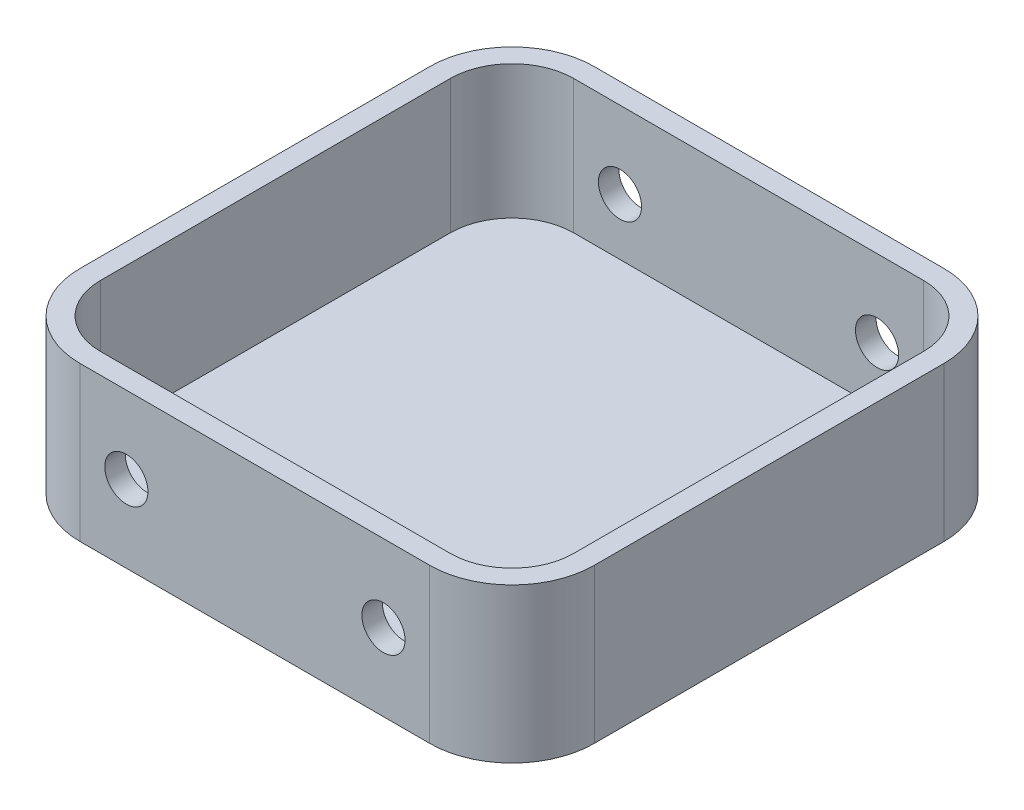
from build123d import *

# Parameters (mm, degrees)
SKETCH_1_W          = 50
SKETCH_1_H          = 50
EXTRUDE_1_DEPTH     = 15
FILLET_1_R          = 8
SHELL_1_T           = -2
SKETCH_2_R          = 2.1
CUT_EXTRUDE_1_DEPTH = 58.879184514


with BuildPart() as part:
    # Sketch 1 → Extrude 1 (new body)
    with BuildSketch(Plane(origin=(0, 0, 0), x_dir=(1, 0, 0), z_dir=(0, 1, 0))):
        Rectangle(SKETCH_1_W, SKETCH_1_H)
    extrude(amount=EXTRUDE_1_DEPTH)

    # Fillet 1
    fillet_1_edges = [part.edges().sort_by_distance(p)[0] for p in [
        (25, 7.5, 25),
        (-25, 7.5, 25),
        (-25, 7.5, -25),
        (25, 7.5, -25),
    ]]
    fillet(fillet_1_edges, radius=FILLET_1_R)

    # Shell 1
    shell_1_openings = [part.faces().sort_by_distance(p)[0] for p in [
        (0, 15, 0),
    ]]
    offset(amount=SHELL_1_T, openings=shell_1_openings, kind=Kind.INTERSECTION)

    # Sketch 2 → Cut-Extrude 1 (cut, through all)
    with BuildSketch(Plane(origin=(0, 0, -25), x_dir=(-1, 0, 0), z_dir=(0, 0, -1))):
        with Locations((12.5, 7.5)):
            Circle(SKETCH_2_R)
        with Locations((-12.5, 7.5)):
            Circle(SKETCH_2_R)
    extrude(amount=-CUT_EXTRUDE_1_DEPTH, mode=Mode.SUBTRACT)


solid = part.part
